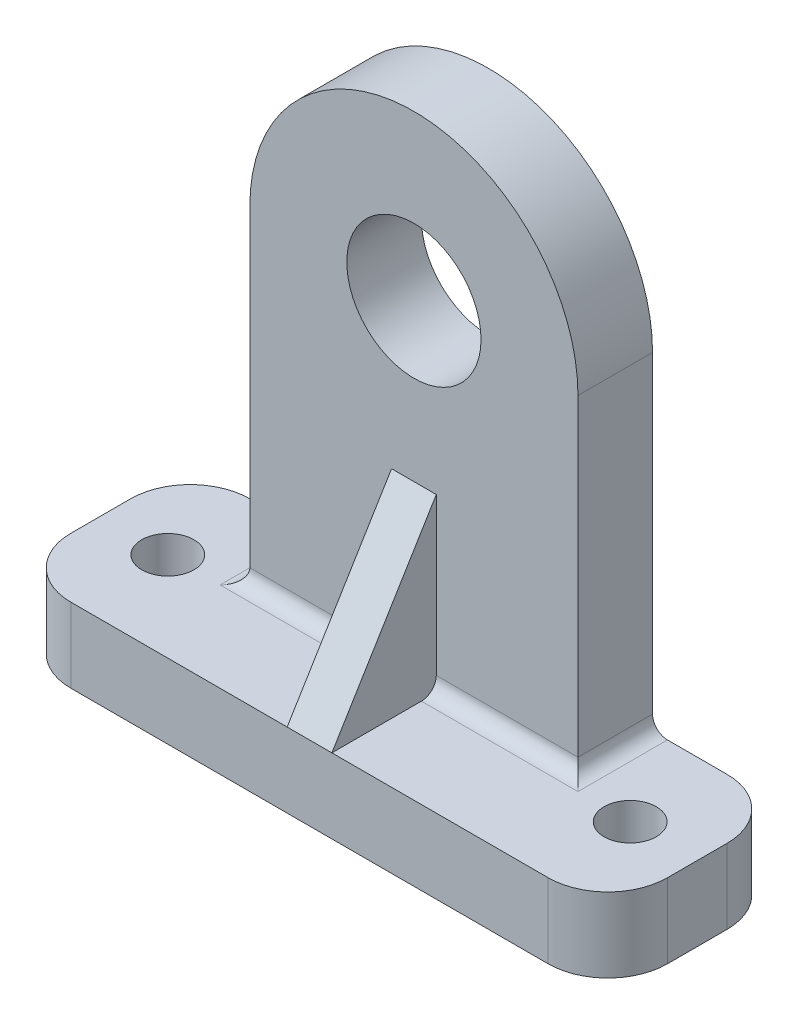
from build123d import *

# Parameters (mm, degrees)
BOSS_EXTRUDE1_DEPTH = 5
SKETCH2_W           = 40
SKETCH2_H           = 12
SKETCH2_R           = 1.75
BOSS_EXTRUDE2_DEPTH = 5
SKETCH1_4_R         = 4.5
CUT_EXTRUDE1_DEPTH  = 8
FILLET1_R           = 1
FILLET2_R           = 4
RIB1_REACH          = 37.679
SKETCH3_WALL_W      = 86.821163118
SKETCH3_WALL_H      = 3


with BuildPart() as part:
    # Sketch1 → Boss-Extrude1 (new body)
    with BuildSketch(Plane.XY):
        with BuildLine():
            Line((-11, 0), (-11, -22))
            Line((-11, -22), (11, -22))
            Line((11, -22), (11, 0))
            ThreePointArc((11, 0), (0, 11), (-11, 0))
        make_face()
    extrude(amount=BOSS_EXTRUDE1_DEPTH)

    # Sketch2 → Boss-Extrude2 (add)
    with BuildSketch(Plane.XZ.offset(22)):
        with Locations((0, 6)):
            Rectangle(SKETCH2_W, SKETCH2_H)
        with Locations(Location((15.5, 6, 0), (0, 0, 270))):
            Circle(SKETCH2_R, mode=Mode.SUBTRACT)
        with Locations(Location((-15.5, 6, 0), (0, 0, 90))):
            Circle(SKETCH2_R, mode=Mode.SUBTRACT)
    extrude(amount=BOSS_EXTRUDE2_DEPTH)

    # Sketch1_4 → Cut-Extrude1 (cut)
    with BuildSketch(Plane.XY):
        Circle(SKETCH1_4_R)
    extrude(amount=CUT_EXTRUDE1_DEPTH, mode=Mode.SUBTRACT)

    # Fillet1
    fillet1_edges = [part.edges().sort_by_distance(p)[0] for p in [
        (0, -22, 5),
        (-11, -22, 2.5),
        (11, -22, 2.5),
    ]]
    fillet(fillet1_edges, radius=FILLET1_R)

    # Fillet2
    fillet2_edges = [part.edges().sort_by_distance(p)[0] for p in [
        (20, -24.5, 0),
        (20, -24.5, 12),
        (-20, -24.5, 12),
        (-20, -24.5, 0),
    ]]
    fillet(fillet2_edges, radius=FILLET2_R)

    # Sketch3 wall → Rib1 (add, up to next)
    with BuildSketch(Plane(origin=(0, -16.25, 8.5), x_dir=(0, -0.854198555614, 0.519946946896), z_dir=(0, -0.519946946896, -0.854198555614)), mode=Mode.PRIVATE) as rib1_sk1:
        Rectangle(SKETCH3_WALL_W, SKETCH3_WALL_H)
    rib1_tool1 = extrude(rib1_sk1.sketch, amount=RIB1_REACH, mode=Mode.PRIVATE) - part.part
    add(rib1_tool1.solids().sort_by_distance((0, -16.25, 8.5))[0])


solid = part.part
